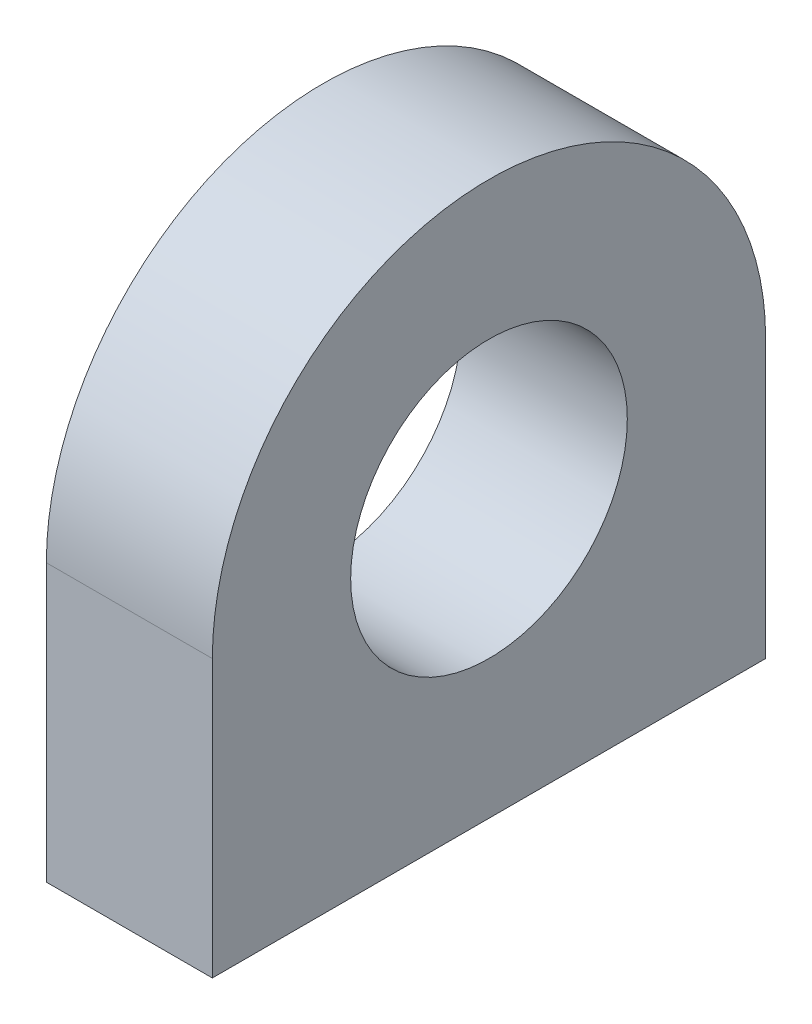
ISO-10303-21;
HEADER;
FILE_DESCRIPTION(('STEP AP214'),'2;1');
FILE_NAME('part.step','',(''),(''),'','','');
FILE_SCHEMA(('AUTOMOTIVE_DESIGN { 1 0 10303 214 1 1 1 1 }'));
ENDSEC;
DATA;
#1=APPLICATION_CONTEXT('core data for automotive mechanical design processes');
#2=APPLICATION_PROTOCOL_DEFINITION('international standard','automotive_design',2000,#1);
#3=PRODUCT_CONTEXT('',#1,'mechanical');
#4=PRODUCT('Part','Part','',(#3));
#5=PRODUCT_RELATED_PRODUCT_CATEGORY('part','',(#4));
#6=PRODUCT_DEFINITION_FORMATION('','',#4);
#7=PRODUCT_DEFINITION_CONTEXT('part definition',#1,'design');
#8=PRODUCT_DEFINITION('design','',#6,#7);
#9=PRODUCT_DEFINITION_SHAPE('','',#8);
#10=(LENGTH_UNIT() NAMED_UNIT(*) SI_UNIT(.MILLI.,.METRE.));
#11=(NAMED_UNIT(*) PLANE_ANGLE_UNIT() SI_UNIT($,.RADIAN.));
#12=(NAMED_UNIT(*) SI_UNIT($,.STERADIAN.) SOLID_ANGLE_UNIT());
#13=UNCERTAINTY_MEASURE_WITH_UNIT(LENGTH_MEASURE(1.E-05),#10,'distance_accuracy_value','');
#14=(GEOMETRIC_REPRESENTATION_CONTEXT(3) GLOBAL_UNCERTAINTY_ASSIGNED_CONTEXT((#13)) GLOBAL_UNIT_ASSIGNED_CONTEXT((#10,
#11,#12)) REPRESENTATION_CONTEXT('',''));
#15=CARTESIAN_POINT('',(0.,0.,0.));
#16=DIRECTION('',(0.,0.,1.));
#17=DIRECTION('',(1.,0.,0.));
#18=AXIS2_PLACEMENT_3D('',#15,#16,#17);
#19=CARTESIAN_POINT('',(30.,50.,0.));
#20=DIRECTION('',(-1.,0.,0.));
#21=DIRECTION('',(0.,0.,1.));
#22=AXIS2_PLACEMENT_3D('',#19,#20,#21);
#23=PLANE('',#22);
#24=DIRECTION('',(0.,1.,0.));
#25=VECTOR('',#24,1.);
#26=CARTESIAN_POINT('',(30.,50.,-50.));
#27=LINE('',#26,#25);
#28=CARTESIAN_POINT('',(30.,0.,-50.));
#29=VERTEX_POINT('',#28);
#30=CARTESIAN_POINT('',(30.,50.,-50.));
#31=VERTEX_POINT('',#30);
#32=EDGE_CURVE('E83',#29,#31,#27,.T.);
#33=ORIENTED_EDGE('',*,*,#32,.T.);
#34=CARTESIAN_POINT('',(30.,50.,0.));
#35=DIRECTION('',(1.,0.,0.));
#36=DIRECTION('',(0.,0.,1.));
#37=AXIS2_PLACEMENT_3D('',#34,#35,#36);
#38=CIRCLE('',#37,50.);
#39=CARTESIAN_POINT('',(30.,50.,50.));
#40=VERTEX_POINT('',#39);
#41=EDGE_CURVE('E78',#31,#40,#38,.T.);
#42=ORIENTED_EDGE('',*,*,#41,.T.);
#43=DIRECTION('',(0.,-1.,0.));
#44=VECTOR('',#43,1.);
#45=CARTESIAN_POINT('',(30.,0.,50.));
#46=LINE('',#45,#44);
#47=CARTESIAN_POINT('',(30.,0.,50.));
#48=VERTEX_POINT('',#47);
#49=EDGE_CURVE('E81',#40,#48,#46,.T.);
#50=ORIENTED_EDGE('',*,*,#49,.T.);
#51=DIRECTION('',(0.,0.,-1.));
#52=VECTOR('',#51,1.);
#53=CARTESIAN_POINT('',(30.,0.,-50.));
#54=LINE('',#53,#52);
#55=EDGE_CURVE('E48',#48,#29,#54,.T.);
#56=ORIENTED_EDGE('',*,*,#55,.T.);
#57=EDGE_LOOP('',(#33,#42,#50,#56));
#58=FACE_BOUND('',#57,.T.);
#59=CARTESIAN_POINT('',(30.,50.,0.));
#60=DIRECTION('',(1.,0.,0.));
#61=DIRECTION('',(0.,0.,-1.));
#62=AXIS2_PLACEMENT_3D('',#59,#60,#61);
#63=CIRCLE('',#62,25.);
#64=CARTESIAN_POINT('',(30.,50.,-25.));
#65=VERTEX_POINT('',#64);
#66=EDGE_CURVE('E98',#65,#65,#63,.T.);
#67=ORIENTED_EDGE('',*,*,#66,.F.);
#68=EDGE_LOOP('',(#67));
#69=FACE_BOUND('',#68,.T.);
#70=ADVANCED_FACE('F31',(#58,#69),#23,.F.);
#71=CARTESIAN_POINT('',(0.,50.,0.));
#72=DIRECTION('',(-1.,0.,0.));
#73=DIRECTION('',(0.,0.,1.));
#74=AXIS2_PLACEMENT_3D('',#71,#72,#73);
#75=PLANE('',#74);
#76=DIRECTION('',(0.,1.,0.));
#77=VECTOR('',#76,1.);
#78=CARTESIAN_POINT('',(0.,50.,-50.));
#79=LINE('',#78,#77);
#80=CARTESIAN_POINT('',(0.,0.,-50.));
#81=VERTEX_POINT('',#80);
#82=CARTESIAN_POINT('',(0.,50.,-50.));
#83=VERTEX_POINT('',#82);
#84=EDGE_CURVE('E95',#81,#83,#79,.T.);
#85=ORIENTED_EDGE('',*,*,#84,.F.);
#86=DIRECTION('',(0.,0.,-1.));
#87=VECTOR('',#86,1.);
#88=CARTESIAN_POINT('',(0.,0.,-50.));
#89=LINE('',#88,#87);
#90=CARTESIAN_POINT('',(0.,0.,50.));
#91=VERTEX_POINT('',#90);
#92=EDGE_CURVE('E71',#91,#81,#89,.T.);
#93=ORIENTED_EDGE('',*,*,#92,.F.);
#94=DIRECTION('',(0.,-1.,0.));
#95=VECTOR('',#94,1.);
#96=CARTESIAN_POINT('',(0.,0.,50.));
#97=LINE('',#96,#95);
#98=CARTESIAN_POINT('',(0.,50.,50.));
#99=VERTEX_POINT('',#98);
#100=EDGE_CURVE('E65',#99,#91,#97,.T.);
#101=ORIENTED_EDGE('',*,*,#100,.F.);
#102=CARTESIAN_POINT('',(0.,50.,0.));
#103=DIRECTION('',(1.,0.,0.));
#104=DIRECTION('',(0.,0.,1.));
#105=AXIS2_PLACEMENT_3D('',#102,#103,#104);
#106=CIRCLE('',#105,50.);
#107=EDGE_CURVE('E87',#83,#99,#106,.T.);
#108=ORIENTED_EDGE('',*,*,#107,.F.);
#109=EDGE_LOOP('',(#85,#93,#101,#108));
#110=FACE_BOUND('',#109,.T.);
#111=CARTESIAN_POINT('',(0.,50.,0.));
#112=DIRECTION('',(1.,0.,0.));
#113=DIRECTION('',(0.,0.,-1.));
#114=AXIS2_PLACEMENT_3D('',#111,#112,#113);
#115=CIRCLE('',#114,25.);
#116=CARTESIAN_POINT('',(0.,50.,-25.));
#117=VERTEX_POINT('',#116);
#118=EDGE_CURVE('E110',#117,#117,#115,.T.);
#119=ORIENTED_EDGE('',*,*,#118,.T.);
#120=EDGE_LOOP('',(#119));
#121=FACE_BOUND('',#120,.T.);
#122=ADVANCED_FACE('F106',(#110,#121),#75,.T.);
#123=CARTESIAN_POINT('',(30.,50.,-50.));
#124=DIRECTION('',(0.,0.,1.));
#125=DIRECTION('',(0.,-1.,0.));
#126=AXIS2_PLACEMENT_3D('',#123,#124,#125);
#127=PLANE('',#126);
#128=ORIENTED_EDGE('',*,*,#84,.T.);
#129=DIRECTION('',(-1.,0.,0.));
#130=VECTOR('',#129,1.);
#131=CARTESIAN_POINT('',(30.,50.,-50.));
#132=LINE('',#131,#130);
#133=EDGE_CURVE('E11',#31,#83,#132,.T.);
#134=ORIENTED_EDGE('',*,*,#133,.F.);
#135=ORIENTED_EDGE('',*,*,#32,.F.);
#136=DIRECTION('',(-1.,0.,0.));
#137=VECTOR('',#136,1.);
#138=CARTESIAN_POINT('',(30.,0.,-50.));
#139=LINE('',#138,#137);
#140=EDGE_CURVE('E91',#29,#81,#139,.T.);
#141=ORIENTED_EDGE('',*,*,#140,.T.);
#142=EDGE_LOOP('',(#128,#134,#135,#141));
#143=FACE_BOUND('',#142,.T.);
#144=ADVANCED_FACE('F33',(#143),#127,.F.);
#145=CARTESIAN_POINT('',(30.,50.,0.));
#146=DIRECTION('',(-1.,0.,0.));
#147=DIRECTION('',(0.,0.,1.));
#148=AXIS2_PLACEMENT_3D('',#145,#146,#147);
#149=CYLINDRICAL_SURFACE('',#148,50.);
#150=ORIENTED_EDGE('',*,*,#107,.T.);
#151=DIRECTION('',(-1.,0.,0.));
#152=VECTOR('',#151,1.);
#153=CARTESIAN_POINT('',(30.,50.,50.));
#154=LINE('',#153,#152);
#155=EDGE_CURVE('E40',#40,#99,#154,.T.);
#156=ORIENTED_EDGE('',*,*,#155,.F.);
#157=ORIENTED_EDGE('',*,*,#41,.F.);
#158=ORIENTED_EDGE('',*,*,#133,.T.);
#159=EDGE_LOOP('',(#150,#156,#157,#158));
#160=FACE_BOUND('',#159,.T.);
#161=ADVANCED_FACE('F86',(#160),#149,.T.);
#162=CARTESIAN_POINT('',(30.,0.,50.));
#163=DIRECTION('',(0.,0.,-1.));
#164=DIRECTION('',(-1.,0.,0.));
#165=AXIS2_PLACEMENT_3D('',#162,#163,#164);
#166=PLANE('',#165);
#167=ORIENTED_EDGE('',*,*,#100,.T.);
#168=DIRECTION('',(-1.,0.,0.));
#169=VECTOR('',#168,1.);
#170=CARTESIAN_POINT('',(30.,0.,50.));
#171=LINE('',#170,#169);
#172=EDGE_CURVE('E88',#48,#91,#171,.T.);
#173=ORIENTED_EDGE('',*,*,#172,.F.);
#174=ORIENTED_EDGE('',*,*,#49,.F.);
#175=ORIENTED_EDGE('',*,*,#155,.T.);
#176=EDGE_LOOP('',(#167,#173,#174,#175));
#177=FACE_BOUND('',#176,.T.);
#178=ADVANCED_FACE('F89',(#177),#166,.F.);
#179=CARTESIAN_POINT('',(30.,0.,-50.));
#180=DIRECTION('',(0.,1.,0.));
#181=DIRECTION('',(0.,0.,1.));
#182=AXIS2_PLACEMENT_3D('',#179,#180,#181);
#183=PLANE('',#182);
#184=ORIENTED_EDGE('',*,*,#92,.T.);
#185=ORIENTED_EDGE('',*,*,#140,.F.);
#186=ORIENTED_EDGE('',*,*,#55,.F.);
#187=ORIENTED_EDGE('',*,*,#172,.T.);
#188=EDGE_LOOP('',(#184,#185,#186,#187));
#189=FACE_BOUND('',#188,.T.);
#190=ADVANCED_FACE('F103',(#189),#183,.F.);
#191=CARTESIAN_POINT('',(30.,50.,0.));
#192=DIRECTION('',(-1.,0.,0.));
#193=DIRECTION('',(0.,0.,1.));
#194=AXIS2_PLACEMENT_3D('',#191,#192,#193);
#195=CYLINDRICAL_SURFACE('',#194,25.);
#196=ORIENTED_EDGE('',*,*,#66,.T.);
#197=EDGE_LOOP('',(#196));
#198=FACE_BOUND('',#197,.T.);
#199=ORIENTED_EDGE('',*,*,#118,.F.);
#200=EDGE_LOOP('',(#199));
#201=FACE_BOUND('',#200,.T.);
#202=ADVANCED_FACE('F116',(#198,#201),#195,.F.);
#203=CLOSED_SHELL('',(#70,#122,#144,#161,#178,#190,#202));
#204=MANIFOLD_SOLID_BREP('B2',#203);
#205=ADVANCED_BREP_SHAPE_REPRESENTATION('',(#18,#204),#14);
#206=SHAPE_DEFINITION_REPRESENTATION(#9,#205);
ENDSEC;
END-ISO-10303-21;
